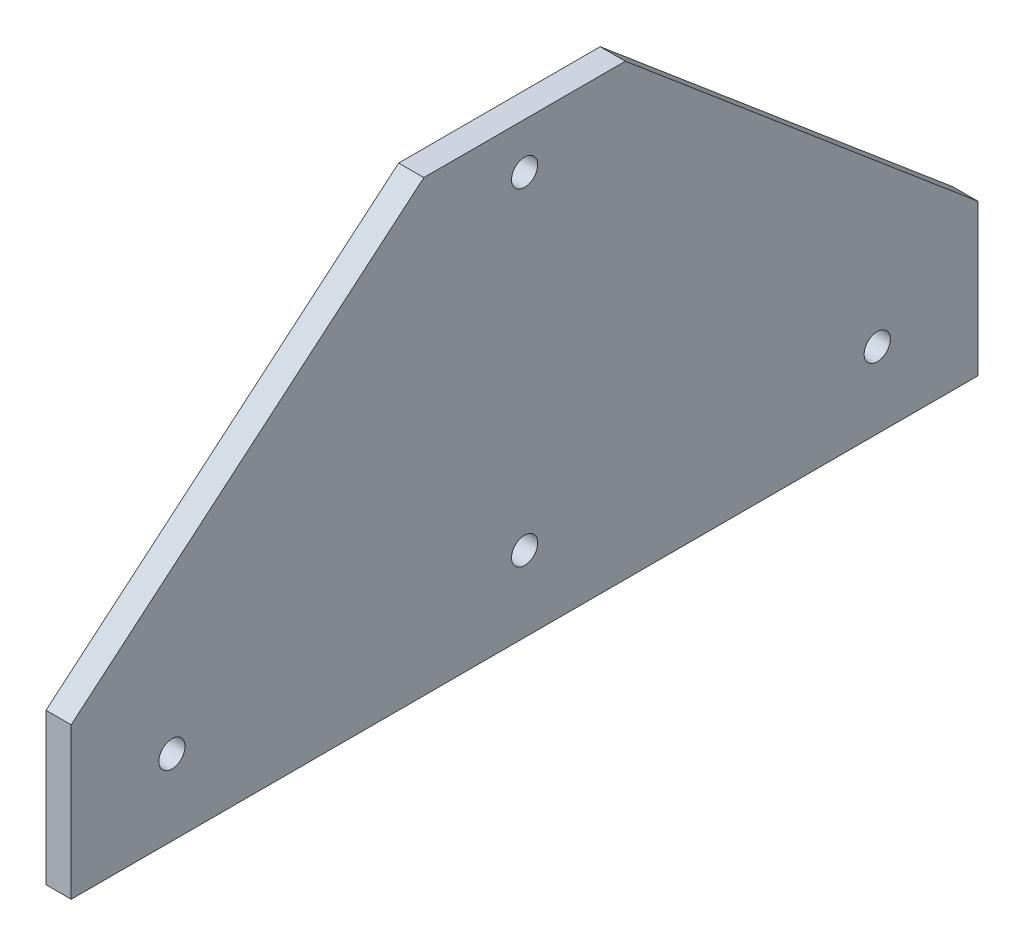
from build123d import *

# Parameters (mm, degrees)
BOSS_EXTRUDE1_DEPTH = 6.35
SKETCH4_R           = 3.302
CUT_EXTRUDE1_DEPTH  = 212.494547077


with BuildPart() as part:
    # Sketch3 → Boss-Extrude1 (new body)
    with BuildSketch(Plane(origin=(0, 0, 0), x_dir=(0, 0, -1), z_dir=(1, 0, 0))):
        Polygon((-77.634507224, 34.864487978), (150.965492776, 34.864487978), (150.965492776, 72.964487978), (62.065492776, 147.983245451), (11.265492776, 147.983245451), (-77.634507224, 72.964487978), align=None)
    extrude(amount=BOSS_EXTRUDE1_DEPTH)

    # Sketch4 → Cut-Extrude1 (cut, through all)
    with BuildSketch(Plane.ZY):
        with Locations((52.234507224, 53.914487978)):
            Circle(SKETCH4_R)
        with Locations((-36.665492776, 53.914487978)):
            Circle(SKETCH4_R)
        with Locations((-36.665492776, 136.464487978)):
            Circle(SKETCH4_R)
        with Locations((-125.565492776, 53.914487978)):
            Circle(SKETCH4_R)
    extrude(amount=-CUT_EXTRUDE1_DEPTH, mode=Mode.SUBTRACT)


solid = part.part
